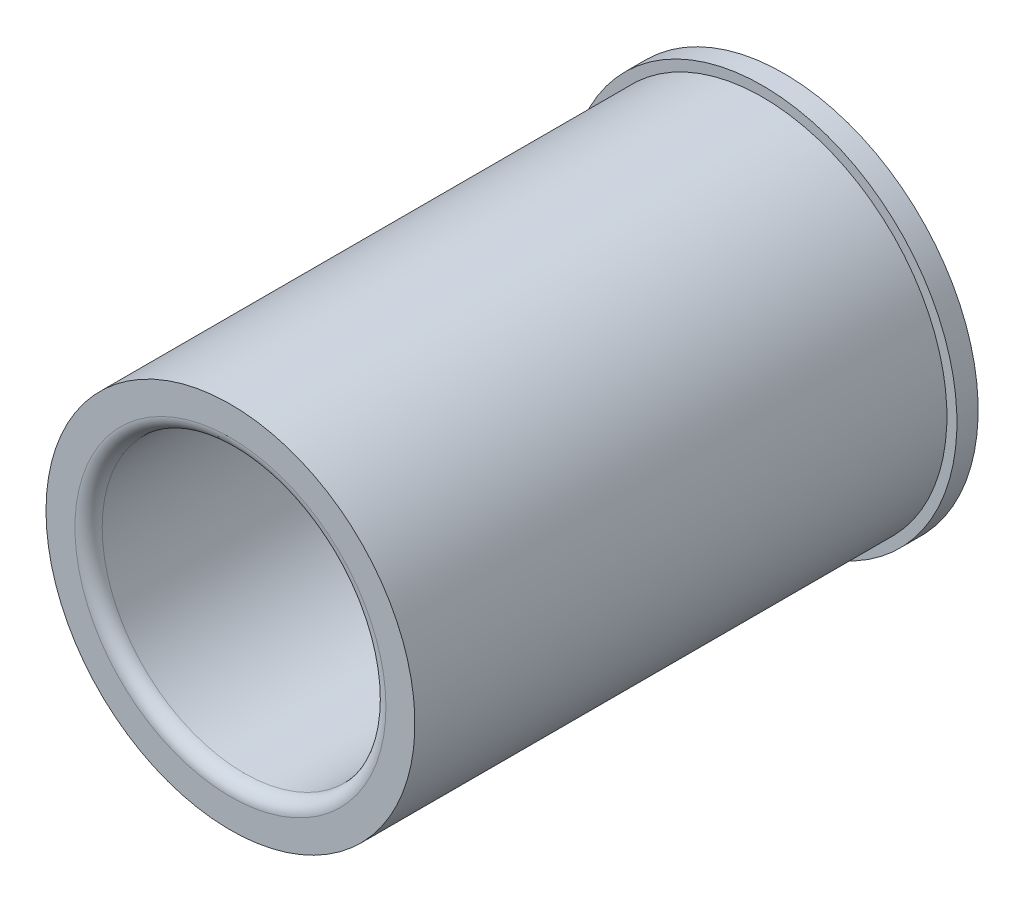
ISO-10303-21;
HEADER;
FILE_DESCRIPTION(('STEP AP214'),'2;1');
FILE_NAME('part.step','',(''),(''),'','','');
FILE_SCHEMA(('AUTOMOTIVE_DESIGN { 1 0 10303 214 1 1 1 1 }'));
ENDSEC;
DATA;
#1=APPLICATION_CONTEXT('core data for automotive mechanical design processes');
#2=APPLICATION_PROTOCOL_DEFINITION('international standard','automotive_design',2000,#1);
#3=PRODUCT_CONTEXT('',#1,'mechanical');
#4=PRODUCT('Part','Part','',(#3));
#5=PRODUCT_RELATED_PRODUCT_CATEGORY('part','',(#4));
#6=PRODUCT_DEFINITION_FORMATION('','',#4);
#7=PRODUCT_DEFINITION_CONTEXT('part definition',#1,'design');
#8=PRODUCT_DEFINITION('design','',#6,#7);
#9=PRODUCT_DEFINITION_SHAPE('','',#8);
#10=(LENGTH_UNIT() NAMED_UNIT(*) SI_UNIT(.MILLI.,.METRE.));
#11=(NAMED_UNIT(*) PLANE_ANGLE_UNIT() SI_UNIT($,.RADIAN.));
#12=(NAMED_UNIT(*) SI_UNIT($,.STERADIAN.) SOLID_ANGLE_UNIT());
#13=UNCERTAINTY_MEASURE_WITH_UNIT(LENGTH_MEASURE(1.E-05),#10,'distance_accuracy_value','');
#14=(GEOMETRIC_REPRESENTATION_CONTEXT(3) GLOBAL_UNCERTAINTY_ASSIGNED_CONTEXT((#13)) GLOBAL_UNIT_ASSIGNED_CONTEXT((#10,
#11,#12)) REPRESENTATION_CONTEXT('',''));
#15=CARTESIAN_POINT('',(0.,0.,0.));
#16=DIRECTION('',(0.,0.,1.));
#17=DIRECTION('',(1.,0.,0.));
#18=AXIS2_PLACEMENT_3D('',#15,#16,#17);
#19=CARTESIAN_POINT('',(0.,0.,123.825));
#20=DIRECTION('',(0.,0.,-1.));
#21=DIRECTION('',(-1.,0.,0.));
#22=AXIS2_PLACEMENT_3D('',#19,#20,#21);
#23=CYLINDRICAL_SURFACE('',#22,41.28135);
#24=CARTESIAN_POINT('',(0.,0.,4.7498));
#25=DIRECTION('',(0.,0.,-1.));
#26=DIRECTION('',(-1.,0.,0.));
#27=AXIS2_PLACEMENT_3D('',#24,#25,#26);
#28=CIRCLE('',#27,41.28135);
#29=CARTESIAN_POINT('',(-41.28135,0.,4.7498));
#30=VERTEX_POINT('',#29);
#31=EDGE_CURVE('E38',#30,#30,#28,.T.);
#32=ORIENTED_EDGE('',*,*,#31,.F.);
#33=EDGE_LOOP('',(#32));
#34=FACE_BOUND('',#33,.T.);
#35=CARTESIAN_POINT('',(0.,0.,123.825));
#36=DIRECTION('',(0.,0.,-1.));
#37=DIRECTION('',(-1.,0.,0.));
#38=AXIS2_PLACEMENT_3D('',#35,#36,#37);
#39=CIRCLE('',#38,41.28135);
#40=CARTESIAN_POINT('',(-41.28135,0.,123.825));
#41=VERTEX_POINT('',#40);
#42=EDGE_CURVE('E16',#41,#41,#39,.F.);
#43=ORIENTED_EDGE('',*,*,#42,.F.);
#44=EDGE_LOOP('',(#43));
#45=FACE_BOUND('',#44,.T.);
#46=ADVANCED_FACE('F12',(#34,#45),#23,.T.);
#47=CARTESIAN_POINT('',(-41.28135,-41.28135,123.825));
#48=DIRECTION('',(0.,0.,1.));
#49=DIRECTION('',(1.,0.,0.));
#50=AXIS2_PLACEMENT_3D('',#47,#48,#49);
#51=PLANE('',#50);
#52=CARTESIAN_POINT('',(0.,0.,123.825));
#53=DIRECTION('',(0.,0.,1.));
#54=DIRECTION('',(1.,0.,0.));
#55=AXIS2_PLACEMENT_3D('',#52,#53,#54);
#56=CIRCLE('',#55,34.80435);
#57=CARTESIAN_POINT('',(34.80435,0.,123.825));
#58=VERTEX_POINT('',#57);
#59=EDGE_CURVE('E36',#58,#58,#56,.T.);
#60=ORIENTED_EDGE('',*,*,#59,.F.);
#61=EDGE_LOOP('',(#60));
#62=FACE_BOUND('',#61,.T.);
#63=ORIENTED_EDGE('',*,*,#42,.T.);
#64=EDGE_LOOP('',(#63));
#65=FACE_BOUND('',#64,.T.);
#66=ADVANCED_FACE('F45',(#62,#65),#51,.T.);
#67=CARTESIAN_POINT('',(-43.5229,-43.5229,4.7498));
#68=DIRECTION('',(0.,0.,1.));
#69=DIRECTION('',(1.,0.,0.));
#70=AXIS2_PLACEMENT_3D('',#67,#68,#69);
#71=PLANE('',#70);
#72=ORIENTED_EDGE('',*,*,#31,.T.);
#73=EDGE_LOOP('',(#72));
#74=FACE_BOUND('',#73,.T.);
#75=CARTESIAN_POINT('',(0.,0.,4.7498));
#76=DIRECTION('',(0.,0.,-1.));
#77=DIRECTION('',(-1.,0.,0.));
#78=AXIS2_PLACEMENT_3D('',#75,#76,#77);
#79=CIRCLE('',#78,43.5229);
#80=CARTESIAN_POINT('',(-43.5229,0.,4.7498));
#81=VERTEX_POINT('',#80);
#82=EDGE_CURVE('E33',#81,#81,#79,.T.);
#83=ORIENTED_EDGE('',*,*,#82,.F.);
#84=EDGE_LOOP('',(#83));
#85=FACE_BOUND('',#84,.T.);
#86=ADVANCED_FACE('F54',(#74,#85),#71,.T.);
#87=CARTESIAN_POINT('',(0.,0.,120.777));
#88=DIRECTION('',(0.,0.,1.));
#89=DIRECTION('',(1.,0.,0.));
#90=AXIS2_PLACEMENT_3D('',#87,#88,#89);
#91=TOROIDAL_SURFACE('',#90,34.80435,3.04800000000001);
#92=ORIENTED_EDGE('',*,*,#59,.T.);
#93=EDGE_LOOP('',(#92));
#94=FACE_BOUND('',#93,.T.);
#95=CARTESIAN_POINT('',(0.,0.,120.777));
#96=DIRECTION('',(0.,0.,1.));
#97=DIRECTION('',(0.,-1.,0.));
#98=AXIS2_PLACEMENT_3D('',#95,#96,#97);
#99=CIRCLE('',#98,31.75635);
#100=CARTESIAN_POINT('',(0.,-31.75635,120.777));
#101=VERTEX_POINT('',#100);
#102=EDGE_CURVE('E30',#101,#101,#99,.T.);
#103=ORIENTED_EDGE('',*,*,#102,.F.);
#104=EDGE_LOOP('',(#103));
#105=FACE_BOUND('',#104,.T.);
#106=ADVANCED_FACE('F73',(#94,#105),#91,.T.);
#107=CARTESIAN_POINT('',(0.,0.,4.7498));
#108=DIRECTION('',(0.,0.,-1.));
#109=DIRECTION('',(-1.,0.,0.));
#110=AXIS2_PLACEMENT_3D('',#107,#108,#109);
#111=CYLINDRICAL_SURFACE('',#110,43.5229);
#112=ORIENTED_EDGE('',*,*,#82,.T.);
#113=EDGE_LOOP('',(#112));
#114=FACE_BOUND('',#113,.T.);
#115=CARTESIAN_POINT('',(0.,0.,0.));
#116=DIRECTION('',(0.,0.,-1.));
#117=DIRECTION('',(-1.,0.,0.));
#118=AXIS2_PLACEMENT_3D('',#115,#116,#117);
#119=CIRCLE('',#118,43.5229);
#120=CARTESIAN_POINT('',(-43.5229,0.,0.));
#121=VERTEX_POINT('',#120);
#122=EDGE_CURVE('E25',#121,#121,#119,.T.);
#123=ORIENTED_EDGE('',*,*,#122,.F.);
#124=EDGE_LOOP('',(#123));
#125=FACE_BOUND('',#124,.T.);
#126=ADVANCED_FACE('F69',(#114,#125),#111,.T.);
#127=CARTESIAN_POINT('',(0.,0.,0.762000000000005));
#128=DIRECTION('',(0.,0.,1.));
#129=DIRECTION('',(0.,-1.,0.));
#130=AXIS2_PLACEMENT_3D('',#127,#128,#129);
#131=CYLINDRICAL_SURFACE('',#130,31.75635);
#132=CARTESIAN_POINT('',(0.,0.,0.762000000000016));
#133=DIRECTION('',(0.,0.,-1.));
#134=DIRECTION('',(0.,1.,0.));
#135=AXIS2_PLACEMENT_3D('',#132,#133,#134);
#136=CIRCLE('',#135,31.75635);
#137=CARTESIAN_POINT('',(0.,31.75635,0.762000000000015));
#138=VERTEX_POINT('',#137);
#139=EDGE_CURVE('E20',#138,#138,#136,.F.);
#140=ORIENTED_EDGE('',*,*,#139,.F.);
#141=EDGE_LOOP('',(#140));
#142=FACE_BOUND('',#141,.T.);
#143=ORIENTED_EDGE('',*,*,#102,.T.);
#144=EDGE_LOOP('',(#143));
#145=FACE_BOUND('',#144,.T.);
#146=ADVANCED_FACE('F62',(#142,#145),#131,.F.);
#147=CARTESIAN_POINT('',(43.5229,-44.6471127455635,0.));
#148=DIRECTION('',(0.,0.,-1.));
#149=DIRECTION('',(-1.,0.,0.));
#150=AXIS2_PLACEMENT_3D('',#147,#148,#149);
#151=PLANE('',#150);
#152=CARTESIAN_POINT('',(0.,0.,0.));
#153=DIRECTION('',(0.,0.,-1.));
#154=DIRECTION('',(0.,1.,0.));
#155=AXIS2_PLACEMENT_3D('',#152,#153,#154);
#156=CIRCLE('',#155,32.51835);
#157=CARTESIAN_POINT('',(0.,32.51835,0.));
#158=VERTEX_POINT('',#157);
#159=EDGE_CURVE('E8',#158,#158,#156,.T.);
#160=ORIENTED_EDGE('',*,*,#159,.F.);
#161=EDGE_LOOP('',(#160));
#162=FACE_BOUND('',#161,.T.);
#163=ORIENTED_EDGE('',*,*,#122,.T.);
#164=EDGE_LOOP('',(#163));
#165=FACE_BOUND('',#164,.T.);
#166=ADVANCED_FACE('F58',(#162,#165),#151,.T.);
#167=CARTESIAN_POINT('',(0.,0.,0.762000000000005));
#168=DIRECTION('',(0.,0.,-1.));
#169=DIRECTION('',(0.,1.,0.));
#170=AXIS2_PLACEMENT_3D('',#167,#168,#169);
#171=CONICAL_SURFACE('',#170,31.75635,0.785398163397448);
#172=ORIENTED_EDGE('',*,*,#159,.T.);
#173=EDGE_LOOP('',(#172));
#174=FACE_BOUND('',#173,.T.);
#175=ORIENTED_EDGE('',*,*,#139,.T.);
#176=EDGE_LOOP('',(#175));
#177=FACE_BOUND('',#176,.T.);
#178=ADVANCED_FACE('F14',(#174,#177),#171,.F.);
#179=CLOSED_SHELL('',(#46,#66,#86,#106,#126,#146,#166,#178));
#180=MANIFOLD_SOLID_BREP('B1',#179);
#181=ADVANCED_BREP_SHAPE_REPRESENTATION('',(#18,#180),#14);
#182=SHAPE_DEFINITION_REPRESENTATION(#9,#181);
ENDSEC;
END-ISO-10303-21;
